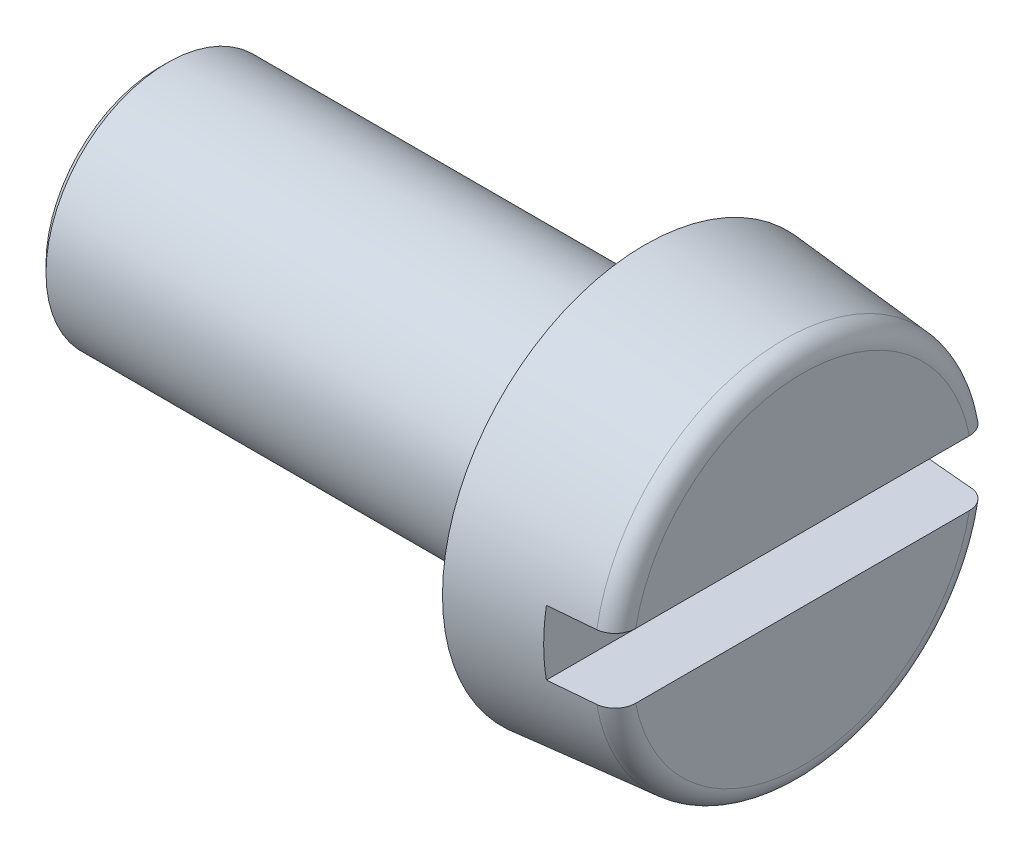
from build123d import *

# Parameters (mm, degrees)
ENL_V_MAT_EXTRU_1_DEPTH = 1.6
CHANFREIN1_SIZE         = 0.2


with BuildPart() as part:
    # Esquisse1 → Base-R_volution (revolve)
    with BuildSketch(Plane.YX, mode=Mode.PRIVATE) as base_r_volution_sk:
        with BuildLine():
            Line((0, 3.9), (4.200628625, 3.9))
            ThreePointArc((4.200628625, 3.9), (4.538423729, 3.768638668), (4.698725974, 3.443577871))
            Line((4.698725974, 3.443577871), (5, 0))
            Line((5, 0), (3, 0))
            Line((3, 0), (3, -12))
            Line((3, -12), (0, -12))
            Line((0, -12), (0, 3.9))
        make_face()
    revolve(base_r_volution_sk.sketch.rotate(Axis((-11.611945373, 0, 0), (1, 0, 0)), 90), axis=Axis((-11.611945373, 0, 0), (1, 0, 0)))

    # Esquisse2 → Enl_v. mat.-Extru.1 (cut)
    with BuildSketch(Plane(origin=(3.9, 0, 0), x_dir=(0, 0, -1), z_dir=(1, 0, 0))):
        with BuildLine():
            Line((4.935585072, 0.8), (-4.935585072, 0.8))
            ThreePointArc((-4.935585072, 0.8), (-5, 0), (-4.935585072, -0.8))
            Line((-4.935585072, -0.8), (4.935585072, -0.8))
            ThreePointArc((4.935585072, -0.8), (5, 0), (4.935585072, 0.8))
        make_face()
    extrude(amount=-ENL_V_MAT_EXTRU_1_DEPTH, mode=Mode.SUBTRACT)

    # Chanfrein1
    chanfrein1_edges = [part.edges().sort_by_distance(p)[0] for p in [
        (-12, 0, -3),
    ]]
    chamfer(chanfrein1_edges, length=CHANFREIN1_SIZE)


solid = part.part
